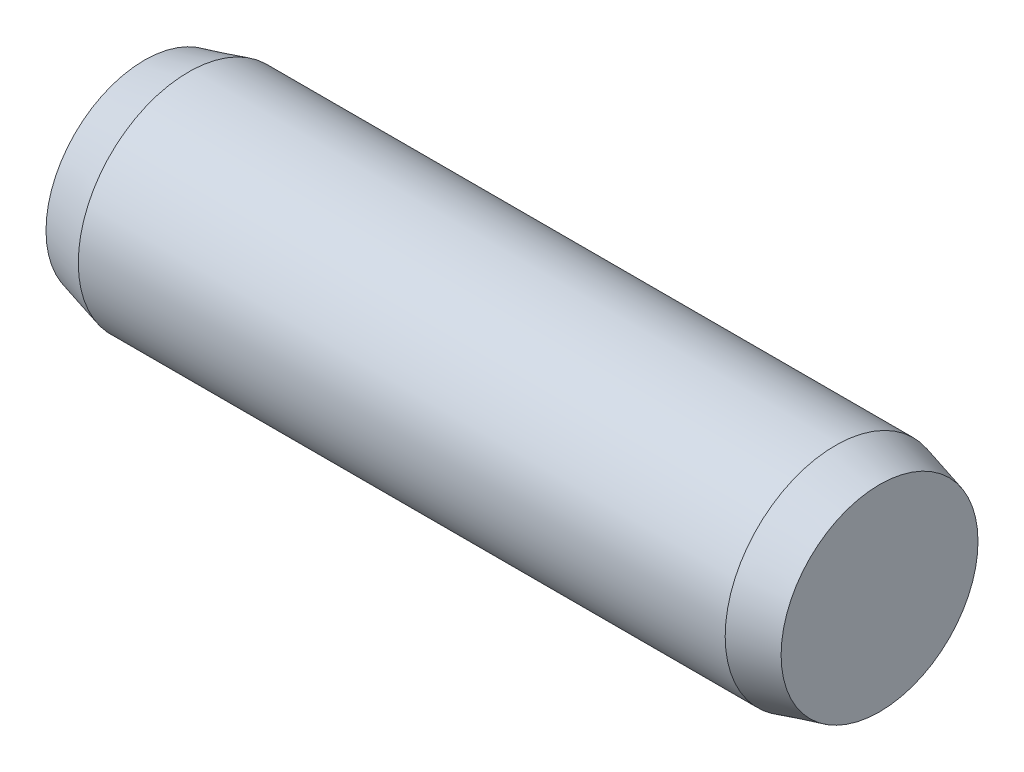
ISO-10303-21;
HEADER;
FILE_DESCRIPTION(('STEP AP214'),'2;1');
FILE_NAME('part.step','',(''),(''),'','','');
FILE_SCHEMA(('AUTOMOTIVE_DESIGN { 1 0 10303 214 1 1 1 1 }'));
ENDSEC;
DATA;
#1=APPLICATION_CONTEXT('core data for automotive mechanical design processes');
#2=APPLICATION_PROTOCOL_DEFINITION('international standard','automotive_design',2000,#1);
#3=PRODUCT_CONTEXT('',#1,'mechanical');
#4=PRODUCT('Part','Part','',(#3));
#5=PRODUCT_RELATED_PRODUCT_CATEGORY('part','',(#4));
#6=PRODUCT_DEFINITION_FORMATION('','',#4);
#7=PRODUCT_DEFINITION_CONTEXT('part definition',#1,'design');
#8=PRODUCT_DEFINITION('design','',#6,#7);
#9=PRODUCT_DEFINITION_SHAPE('','',#8);
#10=(LENGTH_UNIT() NAMED_UNIT(*) SI_UNIT(.MILLI.,.METRE.));
#11=(NAMED_UNIT(*) PLANE_ANGLE_UNIT() SI_UNIT($,.RADIAN.));
#12=(NAMED_UNIT(*) SI_UNIT($,.STERADIAN.) SOLID_ANGLE_UNIT());
#13=UNCERTAINTY_MEASURE_WITH_UNIT(LENGTH_MEASURE(1.E-05),#10,'distance_accuracy_value','');
#14=(GEOMETRIC_REPRESENTATION_CONTEXT(3) GLOBAL_UNCERTAINTY_ASSIGNED_CONTEXT((#13)) GLOBAL_UNIT_ASSIGNED_CONTEXT((#10,
#11,#12)) REPRESENTATION_CONTEXT('',''));
#15=CARTESIAN_POINT('',(0.,0.,0.));
#16=DIRECTION('',(0.,0.,1.));
#17=DIRECTION('',(1.,0.,0.));
#18=AXIS2_PLACEMENT_3D('',#15,#16,#17);
#19=CARTESIAN_POINT('',(0.,2.67846096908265,0.));
#20=DIRECTION('',(1.,0.,0.));
#21=DIRECTION('',(0.,0.,-1.));
#22=AXIS2_PLACEMENT_3D('',#19,#20,#21);
#23=PLANE('',#22);
#24=CARTESIAN_POINT('',(0.,0.,0.));
#25=DIRECTION('',(-1.,0.,0.));
#26=DIRECTION('',(0.,0.,1.));
#27=AXIS2_PLACEMENT_3D('',#24,#25,#26);
#28=CIRCLE('',#27,2.67846096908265);
#29=CARTESIAN_POINT('',(0.,0.,2.67846096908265));
#30=VERTEX_POINT('',#29);
#31=EDGE_CURVE('E10',#30,#30,#28,.T.);
#32=ORIENTED_EDGE('',*,*,#31,.T.);
#33=EDGE_LOOP('',(#32));
#34=FACE_BOUND('',#33,.T.);
#35=ADVANCED_FACE('F28',(#34),#23,.F.);
#36=CARTESIAN_POINT('',(1.2,0.,0.));
#37=DIRECTION('',(1.,0.,0.));
#38=DIRECTION('',(0.,0.,-1.));
#39=AXIS2_PLACEMENT_3D('',#36,#37,#38);
#40=CONICAL_SURFACE('',#39,3.,0.26179938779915);
#41=ORIENTED_EDGE('',*,*,#31,.F.);
#42=EDGE_LOOP('',(#41));
#43=FACE_BOUND('',#42,.T.);
#44=CARTESIAN_POINT('',(1.2,0.,0.));
#45=DIRECTION('',(-1.,0.,0.));
#46=DIRECTION('',(0.,0.,1.));
#47=AXIS2_PLACEMENT_3D('',#44,#45,#46);
#48=CIRCLE('',#47,3.);
#49=CARTESIAN_POINT('',(1.2,0.,3.));
#50=VERTEX_POINT('',#49);
#51=EDGE_CURVE('E34',#50,#50,#48,.T.);
#52=ORIENTED_EDGE('',*,*,#51,.T.);
#53=EDGE_LOOP('',(#52));
#54=FACE_BOUND('',#53,.T.);
#55=ADVANCED_FACE('F60',(#43,#54),#40,.T.);
#56=CARTESIAN_POINT('',(-1.65571726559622,0.,0.));
#57=DIRECTION('',(-1.,0.,0.));
#58=DIRECTION('',(0.,0.,1.));
#59=AXIS2_PLACEMENT_3D('',#56,#57,#58);
#60=CYLINDRICAL_SURFACE('',#59,3.);
#61=ORIENTED_EDGE('',*,*,#51,.F.);
#62=EDGE_LOOP('',(#61));
#63=FACE_BOUND('',#62,.T.);
#64=CARTESIAN_POINT('',(18.8,0.,0.));
#65=DIRECTION('',(-1.,0.,0.));
#66=DIRECTION('',(0.,0.,1.));
#67=AXIS2_PLACEMENT_3D('',#64,#65,#66);
#68=CIRCLE('',#67,3.);
#69=CARTESIAN_POINT('',(18.8,0.,3.));
#70=VERTEX_POINT('',#69);
#71=EDGE_CURVE('E38',#70,#70,#68,.T.);
#72=ORIENTED_EDGE('',*,*,#71,.T.);
#73=EDGE_LOOP('',(#72));
#74=FACE_BOUND('',#73,.T.);
#75=ADVANCED_FACE('F56',(#63,#74),#60,.T.);
#76=CARTESIAN_POINT('',(20.,0.,0.));
#77=DIRECTION('',(-1.,0.,0.));
#78=DIRECTION('',(0.,0.,1.));
#79=AXIS2_PLACEMENT_3D('',#76,#77,#78);
#80=CONICAL_SURFACE('',#79,2.67846096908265,0.26179938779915);
#81=ORIENTED_EDGE('',*,*,#71,.F.);
#82=EDGE_LOOP('',(#81));
#83=FACE_BOUND('',#82,.T.);
#84=CARTESIAN_POINT('',(20.,0.,0.));
#85=DIRECTION('',(-1.,0.,0.));
#86=DIRECTION('',(0.,0.,1.));
#87=AXIS2_PLACEMENT_3D('',#84,#85,#86);
#88=CIRCLE('',#87,2.67846096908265);
#89=CARTESIAN_POINT('',(20.,0.,2.67846096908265));
#90=VERTEX_POINT('',#89);
#91=EDGE_CURVE('E42',#90,#90,#88,.T.);
#92=ORIENTED_EDGE('',*,*,#91,.T.);
#93=EDGE_LOOP('',(#92));
#94=FACE_BOUND('',#93,.T.);
#95=ADVANCED_FACE('F48',(#83,#94),#80,.T.);
#96=CARTESIAN_POINT('',(20.,0.,0.));
#97=DIRECTION('',(-1.,0.,0.));
#98=DIRECTION('',(0.,0.,1.));
#99=AXIS2_PLACEMENT_3D('',#96,#97,#98);
#100=PLANE('',#99);
#101=ORIENTED_EDGE('',*,*,#91,.F.);
#102=EDGE_LOOP('',(#101));
#103=FACE_BOUND('',#102,.T.);
#104=ADVANCED_FACE('F50',(#103),#100,.F.);
#105=CLOSED_SHELL('',(#35,#55,#75,#95,#104));
#106=MANIFOLD_SOLID_BREP('B2',#105);
#107=ADVANCED_BREP_SHAPE_REPRESENTATION('',(#18,#106),#14);
#108=SHAPE_DEFINITION_REPRESENTATION(#9,#107);
ENDSEC;
END-ISO-10303-21;
